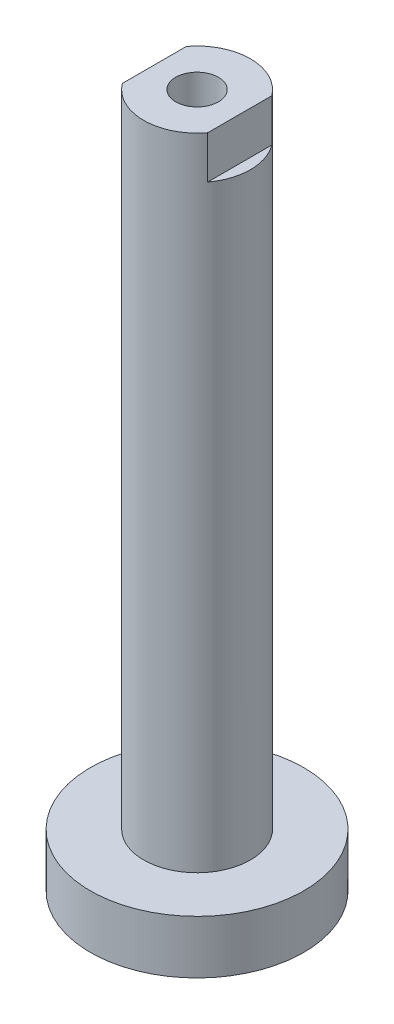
from build123d import *

# Parameters (mm, degrees)
SKETCH2_OUTSIDE_W   = 36.178
SKETCH2_OUTSIDE_H   = 36.178
SKETCH2_OUTSIDE_W_2 = 8
SKETCH2_OUTSIDE_H_2 = 11.606627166
CUT_EXTRUDE1_DEPTH  = 4


with BuildPart() as part:
    # Sketch1 → Revolve1 (revolve)
    with BuildSketch(Plane(origin=(0, 0, 0), x_dir=(0, 0, -1), z_dir=(1, 0, 0))):
        Polygon((0, 0), (0, 50), (2, 50), (2, 60), (5, 60), (5, 0), (10, 0), (10, -5), (0, -5), align=None)
    revolve(axis=Axis((0, 0, 0), (0, 1, 0)))

    # Sketch2 outside → Cut-Extrude1 (cut)
    with BuildSketch(Plane(origin=(0, 60, 0), x_dir=(1, 0, 0), z_dir=(0, 1, 0))):
        Rectangle(SKETCH2_OUTSIDE_W, SKETCH2_OUTSIDE_H)
        Rectangle(SKETCH2_OUTSIDE_W_2, SKETCH2_OUTSIDE_H_2, mode=Mode.SUBTRACT)
    extrude(amount=-CUT_EXTRUDE1_DEPTH, mode=Mode.SUBTRACT)


solid = part.part
